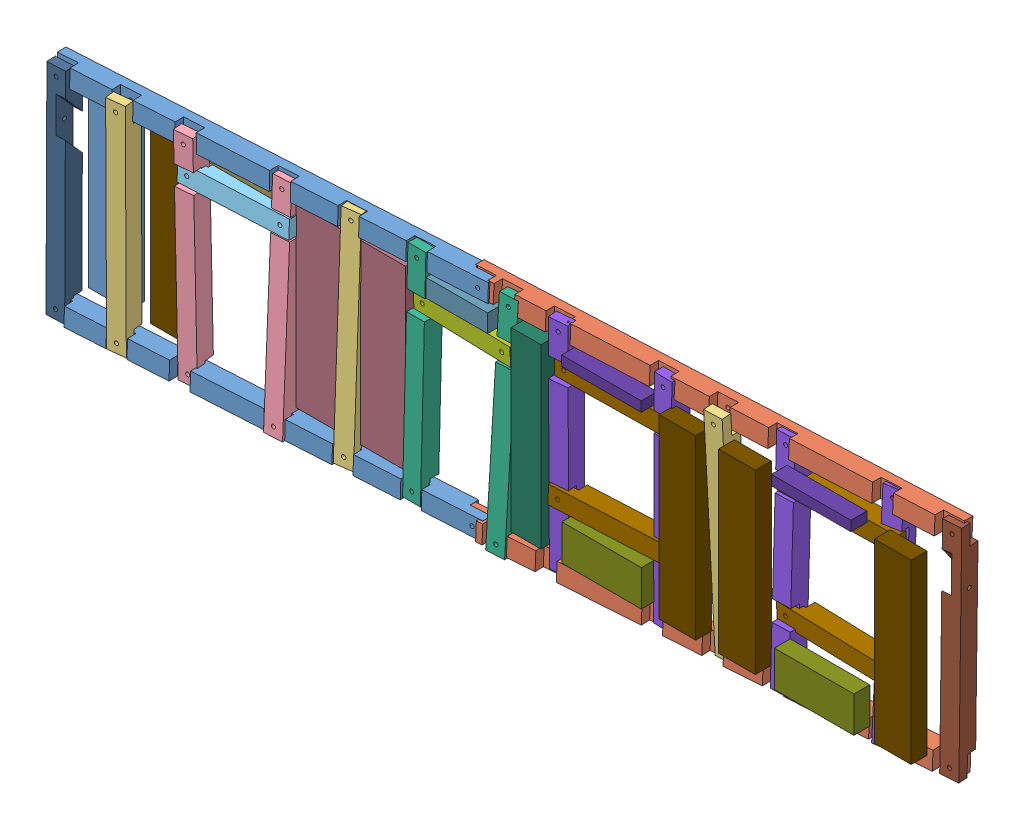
SolidWorks assembly habillage_av.SLDASM, configuration Défaut (file format 3400). Lengths in mm.
Overall size (435.32 113.2 48.35).
38 component instances, 19 part files, 0 mates.
Components (placement in the parent):
- Assemblage_AV-1: Assemblage_AV.SLDASM [Défaut] at (-19.3542 -32.5689 7.2064) x (0.998266 -0.000366 -0.058865) z (0.058848 0.031064 0.997784) size (434.78 112.5 19.3)
  - Base_G-AV-1: Base_G-AV.SLDPRT [Défaut] at (-110.8161 -25.5826 3.0751) size (209 9 9)
  - Base_G-AV-2: Base_G-AV.SLDPRT [Défaut] at (-110.8715 76.586 3.2289) size (209 9 9)
  - Base_D-AV-1: Base_D-AV.SLDPRT [Défaut] at (87.1977 76.6124 2.4605) x (0.999931 0.000601 0.011708) z (-0.011718 0.020718 0.999717) size (235 9 9)
  - Base_D-AV-2: Base_D-AV.SLDPRT [Défaut] at (86.3066 -25.6939 4.7573) x (0.999931 -0.000494 -0.011732) z (0.011736 0.010297 0.999878) size (235 9 9)
  - montant-1: montant.SLDPRT [Default] at (-180.5636 17.55 19.1161) x (-0.001336 -0.999292 -0.037602) z (-0.049357 0.037622 -0.998072) size (110 9 9)
  - montant-2: montant.SLDPRT [Default] at (316.0851 42.1966 17.8366) x (-0.004468 0.996596 0.08232) z (0.023822 0.082403 -0.996314) size (110 9 9)
  - montant-3: montant.SLDPRT [Default] at (136.5542 42.6524 2.5669) x (0.000259 0.999978 -0.006578) z (-0.083118 -0.006534 -0.996518) size (110 9 9)
  - montant_3-4-1: montant_3-4.SLDPRT [Default] at (-106.0703 16.2759 12.4071) x (0.002122 -0.999879 0.01538) z (-0.004429 -0.015389 -0.999872) size (110 9 9)
  - montant_3-4-2: montant_3-4.SLDPRT [Default] at (-149.8924 16.4017 13.6541) x (0.004288 -0.998764 -0.049511) z (-0.0242 0.049393 -0.998486) size (110 9 9)
  - traverse_T1-1: traverse_T1.SLDPRT [Défaut] at (-50.0928 68.8654 11.16) x (0.999821 0.006047 0.017918) z (0.018053 -0.023077 -0.999571) size (54 9 9)
  - montant_6-7-1: montant_6-7.SLDPRT [Default] at (1.6602 17.4904 13.5063) x (-0.00909 -0.999639 0.025276) z (-0.001816 -0.02526 -0.999679) size (110 9 9)
  - montant_6-7-2: montant_6-7.SLDPRT [Default] at (-41.0756 18.5591 5.5097) x (-0.005763 -0.999918 -0.011443) z (0.058023 0.01109 -0.998254) size (110 9 9)
  - traverse_T2-1: traverse_T2.SLDPRT [Défaut] at (60.8773 64.9511 9.8675) x (0.996278 -0.004979 0.08605) z (0.086192 0.065415 -0.994129) size (50 9 9)
  - montant_T3-1: montant_T3.SLDPRT [Default] at (77.2686 18.7415 2.7682) x (-0.006691 -0.99937 -0.034863) z (0.081488 0.034203 -0.996087) size (110 9 9)
  - montant_T3-2: montant_T3.SLDPRT [Default] at (27.5773 18.2825 15.1661) x (0.000597 -0.999343 -0.036231) z (-0.03683 0.036185 -0.998666) size (110 9 9)
  - traverse_T3-1: traverse_T3.SLDPRT [Défaut] at (234.5317 10.9455 9.2261) x (0.995398 0.003735 0.095758) z (0.095211 0.074949 -0.992632) size (59 9 9)
  - traverse_T3-2: traverse_T3.SLDPRT [Défaut] at (293.6902 58.8542 12.5497) x (-0.999407 0.003553 -0.034235) z (0.03436 0.045015 -0.998395) size (59 9 9)
  - traverse_T3-3: traverse_T3.SLDPRT [Défaut] at (127.8701 12.6374 11.3566) x (0.999846 0.005976 0.016475) z (0.016346 0.02103 -0.999645) size (59 9 9)
  - traverse_T3-4: traverse_T3.SLDPRT [Défaut] at (128.5662 68.0188 10.6199) x (0.999049 -0.001077 0.043598) z (0.043608 0.036267 -0.99839) size (59 9 9)
  - montant_T3-3: montant_T3.SLDPRT [Default] at (184.7268 18.1281 24.044) x (0.001847 -0.999665 0.025808) z (-0.114227 -0.02585 -0.993118) size (110 9 9)
  - montant_T3-4: montant_T3.SLDPRT [Default] at (134.2693 16.9427 8.082) x (0.009085 -0.999909 0.009923) z (0.036114 -0.009589 -0.999302) size (110 9 9)
  - montant_1-1: montant_1.SLDPRT [Default] at (-1.4118 41.4337 13.6128) x (-0.000138 0.999636 0.026995) z (0.014592 0.026994 -0.999529) size (110 9 9)
  - montant13-30-1: montant13-30.SLDPRT [Default] at (424.2608 42.2621 10.3838) x (-0.001463 0.999872 0.015903) z (-0.014868 0.01588 -0.999763) size (110 9 9)
- AV_3-4-1: AV_3-4.SLDPRT [Défaut] at (-58.7843 37.6655 5.2761) size (35 5 8)
- AV_4-5-1: AV_4-5.SLDPRT [Défaut] at (-15.3301 -47.0798 5.2761) size (22.5 89 8)
- AV_6-7-1: AV_6-7.SLDPRT [Défaut] at (50.079 33.2908 5.2761) size (31 9 8)
- AV_7-8-1: AV_7-8.SLDPRT [Défaut] at (92.9085 -47.1455 5.2761) size (15 89 8)
- AV_8-9b-1: AV_8-9b.SLDPRT [Défaut] at (118.4044 -47.9925 5.2761) size (40 18 8)
- AV_8-9h-1: AV_8-9h.SLDPRT [Défaut] at (118.3386 37.6327 5.2761) size (40 5 8)
- AV_9-10-1: AV_9-10.SLDPRT [Défaut] at (167.2488 -47.8714 5.2761) size (18.5 89 8)
- AV_9-10-2: AV_9-10.SLDPRT [Défaut] at (275.5967 -47.8714 5.2761) size (18.5 89 8)
- AV_9-10-3: AV_9-10.SLDPRT [Défaut] at (197.2302 -47.8714 5.2761) size (18.5 89 8)
- AV_9-10-4: AV_9-10.SLDPRT [Défaut] at (-88.5302 -47.0469 5.2761) size (18.5 89 8)
- AV_8-9b-2: AV_8-9b.SLDPRT [Défaut] at (225.2677 -49.5756 5.2761) size (40 18 8)
- AV_8-9h-2: AV_8-9h.SLDPRT [Défaut] at (223.7831 38.3585 5.2761) size (40 5 8)
- AV_1-2-2: AV_1-2.SLDPRT [Défaut] at (-119.5594 -47.0359 5.2761) size (20 89 8)
- AV_4-5-2: AV_4-5.SLDPRT [Défaut] at (17.2775 -47.0359 5.2761) size (22.5 89 8)
